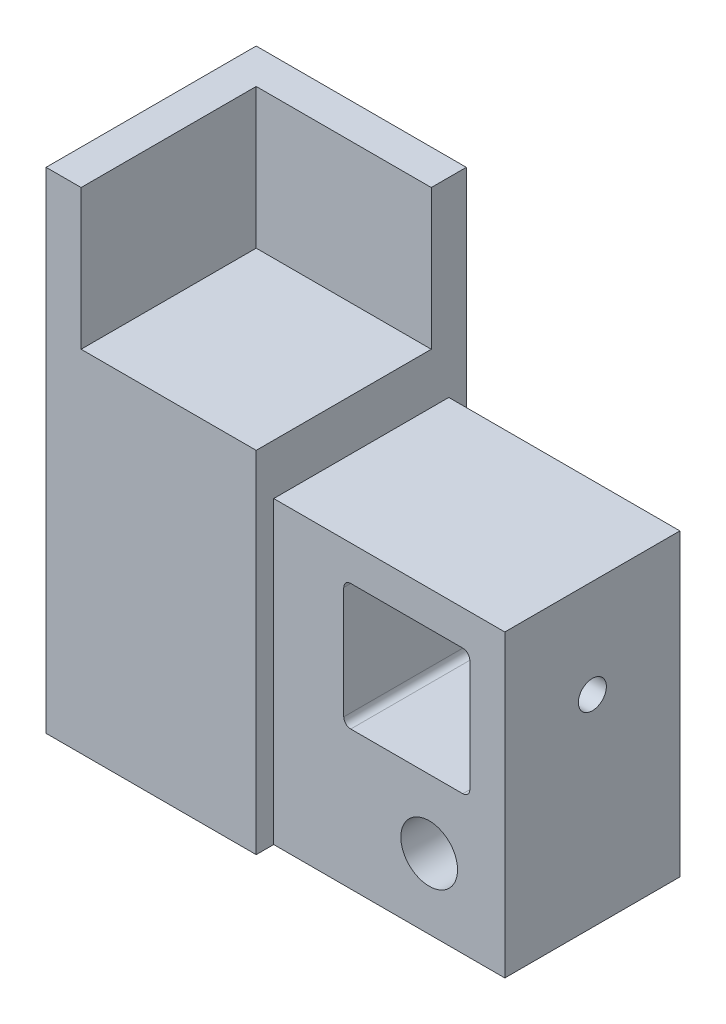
from build123d import *

# Parameters (mm, degrees)
CROQUIS1_W                   = 30
CROQUIS1_H                   = 30
SALIENTE_EXTRUIR1_DEPTH      = 50
CROQUIS2_W                   = 20
CROQUIS2_H                   = 20
CORTAR_EXTRUIR1_DEPTH        = 45
SALIENTE_EXTRUIR2_DEPTH      = 12.5
SALIENTE_EXTRUIR2_DEPTH_BACK = 12.5
CROQUIS3_W                   = 33
CROQUIS3_H                   = 42.79
CROQUIS3_R                   = 4.05
CROQUIS3_W_2                 = 18
CROQUIS3_H_2                 = 18
REDONDEO2_R                  = 1
SALIENTE_EXTRUIR3_START      = -10
CROQUIS5_W                   = 33
CROQUIS5_H                   = 15
SALIENTE_EXTRUIR3_DEPTH      = 7.5
CROQUIS6_R                   = 2
CORTAR_EXTRUIR3_DEPTH        = 28
SALIENTE_EXTRUIR4_DEPTH      = 20


with BuildPart() as part:
    # Croquis1 → Saliente-Extruir1 (new body)
    with BuildSketch(Plane(origin=(0, 0, 0), x_dir=(1, 0, 0), z_dir=(0, 1, 0))):
        Rectangle(CROQUIS1_W, CROQUIS1_H)
    extrude(amount=SALIENTE_EXTRUIR1_DEPTH)

    # Croquis2 → Cortar-Extruir1 (cut)
    with BuildSketch(Plane.XZ):
        Rectangle(CROQUIS2_W, CROQUIS2_H)
    extrude(amount=-CORTAR_EXTRUIR1_DEPTH, mode=Mode.SUBTRACT)

    # Croquis3 → Saliente-Extruir2 (add, two sides: drawn at the far end of the back side and taken through both)
    with BuildSketch(Plane.XY.offset(-SALIENTE_EXTRUIR2_DEPTH_BACK)):
        with Locations((31.5, 21.395)):
            Rectangle(CROQUIS3_W, CROQUIS3_H)
        with Locations((37.2, 10)):
            Circle(CROQUIS3_R, mode=Mode.SUBTRACT)
        with Locations((34, 28.79)):
            Rectangle(CROQUIS3_W_2, CROQUIS3_H_2, mode=Mode.SUBTRACT)
    extrude(amount=SALIENTE_EXTRUIR2_DEPTH + SALIENTE_EXTRUIR2_DEPTH_BACK)

    # Redondeo2
    redondeo2_edges = [part.edges().sort_by_distance(p)[0] for p in [
        (43, 37.79, 0),
        (43, 19.79, 0),
        (25, 19.79, 0),
        (25, 37.79, 0),
    ]]
    fillet(redondeo2_edges, radius=REDONDEO2_R)

    # Croquis5 → Saliente-Extruir3 (add)
    with BuildSketch(Plane(origin=(0, 0, -12.5), x_dir=(-1, 0, 0), z_dir=(0, 0, -1)).offset(SALIENTE_EXTRUIR3_START)):
        with Locations((-31.5, 7.5)):
            Rectangle(CROQUIS5_W, CROQUIS5_H)
    extrude(amount=-SALIENTE_EXTRUIR3_DEPTH)

    # Croquis6 → Cortar-Extruir3 (cut)
    with BuildSketch(Plane(origin=(48, 0, 0), x_dir=(0, 0, -1), z_dir=(1, 0, 0))):
        with Locations(Location((0, 28.8, 0), (0, 0, 270))):
            Circle(CROQUIS6_R)
    extrude(amount=-CORTAR_EXTRUIR3_DEPTH, mode=Mode.SUBTRACT)

    # Croquis7 → Saliente-Extruir4 (add)
    with BuildSketch(Plane(origin=(0, 50, 0), x_dir=(1, 0, 0), z_dir=(0, 1, 0))):
        Polygon((15, 15), (15, 10), (-10, 10), (-10, -15), (-15, -15), (-15, 15), align=None)
    extrude(amount=SALIENTE_EXTRUIR4_DEPTH)


solid = part.part
